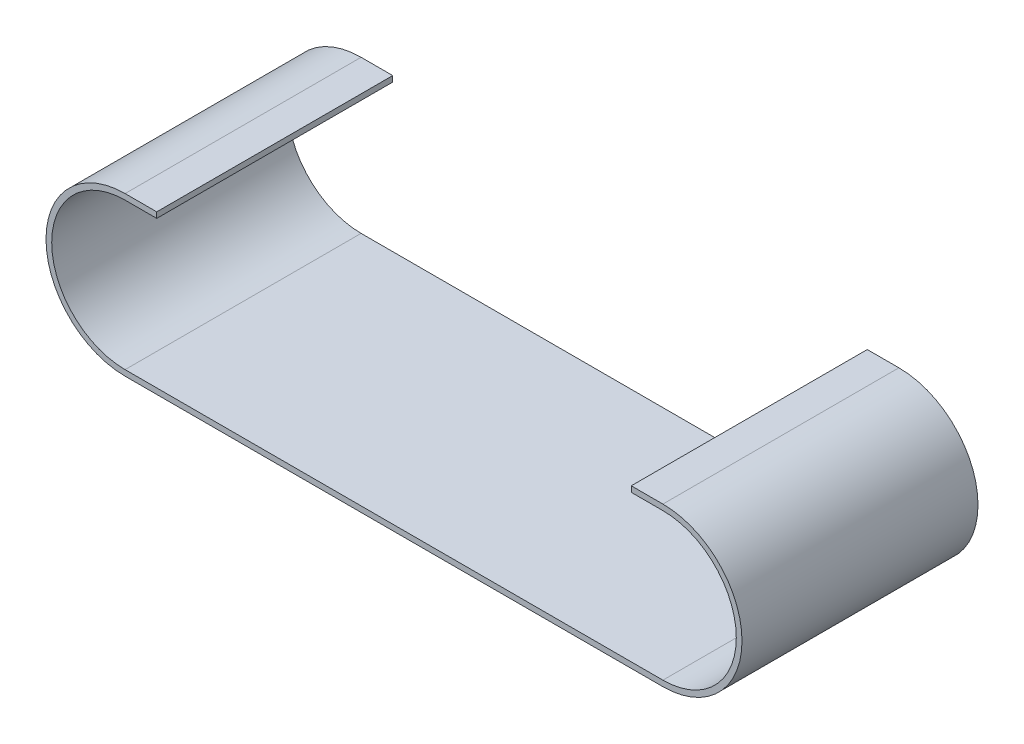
ISO-10303-21;
HEADER;
FILE_DESCRIPTION(('STEP AP214'),'2;1');
FILE_NAME('part.step','',(''),(''),'','','');
FILE_SCHEMA(('AUTOMOTIVE_DESIGN { 1 0 10303 214 1 1 1 1 }'));
ENDSEC;
DATA;
#1=APPLICATION_CONTEXT('core data for automotive mechanical design processes');
#2=APPLICATION_PROTOCOL_DEFINITION('international standard','automotive_design',2000,#1);
#3=PRODUCT_CONTEXT('',#1,'mechanical');
#4=PRODUCT('Part','Part','',(#3));
#5=PRODUCT_RELATED_PRODUCT_CATEGORY('part','',(#4));
#6=PRODUCT_DEFINITION_FORMATION('','',#4);
#7=PRODUCT_DEFINITION_CONTEXT('part definition',#1,'design');
#8=PRODUCT_DEFINITION('design','',#6,#7);
#9=PRODUCT_DEFINITION_SHAPE('','',#8);
#10=(LENGTH_UNIT() NAMED_UNIT(*) SI_UNIT(.MILLI.,.METRE.));
#11=(NAMED_UNIT(*) PLANE_ANGLE_UNIT() SI_UNIT($,.RADIAN.));
#12=(NAMED_UNIT(*) SI_UNIT($,.STERADIAN.) SOLID_ANGLE_UNIT());
#13=UNCERTAINTY_MEASURE_WITH_UNIT(LENGTH_MEASURE(1.E-05),#10,'distance_accuracy_value','');
#14=(GEOMETRIC_REPRESENTATION_CONTEXT(3) GLOBAL_UNCERTAINTY_ASSIGNED_CONTEXT((#13)) GLOBAL_UNIT_ASSIGNED_CONTEXT((#10,
#11,#12)) REPRESENTATION_CONTEXT('',''));
#15=CARTESIAN_POINT('',(0.,0.,0.));
#16=DIRECTION('',(0.,0.,1.));
#17=DIRECTION('',(1.,0.,0.));
#18=AXIS2_PLACEMENT_3D('',#15,#16,#17);
#19=CARTESIAN_POINT('',(-850.,0.,-746.));
#20=DIRECTION('',(0.,0.,1.));
#21=DIRECTION('',(1.,0.,0.));
#22=AXIS2_PLACEMENT_3D('',#19,#20,#21);
#23=CYLINDRICAL_SURFACE('',#22,232.);
#24=CARTESIAN_POINT('',(-850.,0.,0.));
#25=DIRECTION('',(0.,0.,-1.));
#26=DIRECTION('',(1.,0.,0.));
#27=AXIS2_PLACEMENT_3D('',#24,#25,#26);
#28=CIRCLE('',#27,232.);
#29=CARTESIAN_POINT('',(-850.,-232.,0.));
#30=VERTEX_POINT('',#29);
#31=CARTESIAN_POINT('',(-850.,232.,0.));
#32=VERTEX_POINT('',#31);
#33=EDGE_CURVE('E154',#30,#32,#28,.T.);
#34=ORIENTED_EDGE('',*,*,#33,.F.);
#35=DIRECTION('',(0.,0.,1.));
#36=VECTOR('',#35,1.);
#37=CARTESIAN_POINT('',(-850.,-232.,-746.));
#38=LINE('',#37,#36);
#39=CARTESIAN_POINT('',(-850.,-232.,-746.));
#40=VERTEX_POINT('',#39);
#41=EDGE_CURVE('E11',#40,#30,#38,.T.);
#42=ORIENTED_EDGE('',*,*,#41,.F.);
#43=CARTESIAN_POINT('',(-850.,0.,-746.));
#44=DIRECTION('',(0.,0.,-1.));
#45=DIRECTION('',(1.,0.,0.));
#46=AXIS2_PLACEMENT_3D('',#43,#44,#45);
#47=CIRCLE('',#46,232.);
#48=CARTESIAN_POINT('',(-850.,232.,-746.));
#49=VERTEX_POINT('',#48);
#50=EDGE_CURVE('E186',#40,#49,#47,.T.);
#51=ORIENTED_EDGE('',*,*,#50,.T.);
#52=DIRECTION('',(0.,0.,1.));
#53=VECTOR('',#52,1.);
#54=CARTESIAN_POINT('',(-850.,232.,-746.));
#55=LINE('',#54,#53);
#56=EDGE_CURVE('E36',#49,#32,#55,.T.);
#57=ORIENTED_EDGE('',*,*,#56,.T.);
#58=EDGE_LOOP('',(#34,#42,#51,#57));
#59=FACE_BOUND('',#58,.T.);
#60=ADVANCED_FACE('F33',(#59),#23,.F.);
#61=CARTESIAN_POINT('',(-850.,-232.,-746.));
#62=DIRECTION('',(0.,1.,0.));
#63=DIRECTION('',(0.,0.,1.));
#64=AXIS2_PLACEMENT_3D('',#61,#62,#63);
#65=PLANE('',#64);
#66=DIRECTION('',(-1.,0.,0.));
#67=VECTOR('',#66,1.);
#68=CARTESIAN_POINT('',(-850.,-232.,0.));
#69=LINE('',#68,#67);
#70=CARTESIAN_POINT('',(850.,-232.,0.));
#71=VERTEX_POINT('',#70);
#72=EDGE_CURVE('E184',#71,#30,#69,.T.);
#73=ORIENTED_EDGE('',*,*,#72,.F.);
#74=DIRECTION('',(0.,0.,1.));
#75=VECTOR('',#74,1.);
#76=CARTESIAN_POINT('',(850.,-232.,-746.));
#77=LINE('',#76,#75);
#78=CARTESIAN_POINT('',(850.,-232.,-746.));
#79=VERTEX_POINT('',#78);
#80=EDGE_CURVE('E42',#79,#71,#77,.T.);
#81=ORIENTED_EDGE('',*,*,#80,.F.);
#82=DIRECTION('',(-1.,0.,0.));
#83=VECTOR('',#82,1.);
#84=CARTESIAN_POINT('',(-850.,-232.,-746.));
#85=LINE('',#84,#83);
#86=EDGE_CURVE('E144',#79,#40,#85,.T.);
#87=ORIENTED_EDGE('',*,*,#86,.T.);
#88=ORIENTED_EDGE('',*,*,#41,.T.);
#89=EDGE_LOOP('',(#73,#81,#87,#88));
#90=FACE_BOUND('',#89,.T.);
#91=ADVANCED_FACE('F206',(#90),#65,.T.);
#92=CARTESIAN_POINT('',(850.,0.,-746.));
#93=DIRECTION('',(0.,0.,1.));
#94=DIRECTION('',(1.,0.,0.));
#95=AXIS2_PLACEMENT_3D('',#92,#93,#94);
#96=CYLINDRICAL_SURFACE('',#95,232.);
#97=CARTESIAN_POINT('',(850.,0.,0.));
#98=DIRECTION('',(0.,0.,-1.));
#99=DIRECTION('',(1.,0.,0.));
#100=AXIS2_PLACEMENT_3D('',#97,#98,#99);
#101=CIRCLE('',#100,232.);
#102=CARTESIAN_POINT('',(850.,232.,0.));
#103=VERTEX_POINT('',#102);
#104=EDGE_CURVE('E131',#103,#71,#101,.T.);
#105=ORIENTED_EDGE('',*,*,#104,.F.);
#106=DIRECTION('',(0.,0.,1.));
#107=VECTOR('',#106,1.);
#108=CARTESIAN_POINT('',(850.,232.,-746.));
#109=LINE('',#108,#107);
#110=CARTESIAN_POINT('',(850.,232.,-746.));
#111=VERTEX_POINT('',#110);
#112=EDGE_CURVE('E126',#111,#103,#109,.T.);
#113=ORIENTED_EDGE('',*,*,#112,.F.);
#114=CARTESIAN_POINT('',(850.,0.,-746.));
#115=DIRECTION('',(0.,0.,-1.));
#116=DIRECTION('',(1.,0.,0.));
#117=AXIS2_PLACEMENT_3D('',#114,#115,#116);
#118=CIRCLE('',#117,232.);
#119=EDGE_CURVE('E129',#111,#79,#118,.T.);
#120=ORIENTED_EDGE('',*,*,#119,.T.);
#121=ORIENTED_EDGE('',*,*,#80,.T.);
#122=EDGE_LOOP('',(#105,#113,#120,#121));
#123=FACE_BOUND('',#122,.T.);
#124=ADVANCED_FACE('F128',(#123),#96,.F.);
#125=CARTESIAN_POINT('',(850.,232.,-746.));
#126=DIRECTION('',(0.,-1.,0.));
#127=DIRECTION('',(0.,0.,-1.));
#128=AXIS2_PLACEMENT_3D('',#125,#126,#127);
#129=PLANE('',#128);
#130=DIRECTION('',(1.,0.,0.));
#131=VECTOR('',#130,1.);
#132=CARTESIAN_POINT('',(850.,232.,0.));
#133=LINE('',#132,#131);
#134=CARTESIAN_POINT('',(750.,232.,0.));
#135=VERTEX_POINT('',#134);
#136=EDGE_CURVE('E181',#135,#103,#133,.T.);
#137=ORIENTED_EDGE('',*,*,#136,.F.);
#138=DIRECTION('',(0.,0.,1.));
#139=VECTOR('',#138,1.);
#140=CARTESIAN_POINT('',(750.,232.,-746.));
#141=LINE('',#140,#139);
#142=CARTESIAN_POINT('',(750.,232.,-746.));
#143=VERTEX_POINT('',#142);
#144=EDGE_CURVE('E136',#143,#135,#141,.T.);
#145=ORIENTED_EDGE('',*,*,#144,.F.);
#146=DIRECTION('',(1.,0.,0.));
#147=VECTOR('',#146,1.);
#148=CARTESIAN_POINT('',(850.,232.,-746.));
#149=LINE('',#148,#147);
#150=EDGE_CURVE('E142',#143,#111,#149,.T.);
#151=ORIENTED_EDGE('',*,*,#150,.T.);
#152=ORIENTED_EDGE('',*,*,#112,.T.);
#153=EDGE_LOOP('',(#137,#145,#151,#152));
#154=FACE_BOUND('',#153,.T.);
#155=ADVANCED_FACE('F146',(#154),#129,.T.);
#156=CARTESIAN_POINT('',(750.,250.,-746.));
#157=DIRECTION('',(-1.,0.,0.));
#158=DIRECTION('',(0.,0.,1.));
#159=AXIS2_PLACEMENT_3D('',#156,#157,#158);
#160=PLANE('',#159);
#161=DIRECTION('',(0.,-1.,0.));
#162=VECTOR('',#161,1.);
#163=CARTESIAN_POINT('',(750.,250.,0.));
#164=LINE('',#163,#162);
#165=CARTESIAN_POINT('',(750.,250.,0.));
#166=VERTEX_POINT('',#165);
#167=EDGE_CURVE('E178',#166,#135,#164,.T.);
#168=ORIENTED_EDGE('',*,*,#167,.F.);
#169=DIRECTION('',(0.,0.,1.));
#170=VECTOR('',#169,1.);
#171=CARTESIAN_POINT('',(750.,250.,-746.));
#172=LINE('',#171,#170);
#173=CARTESIAN_POINT('',(750.,250.,-746.));
#174=VERTEX_POINT('',#173);
#175=EDGE_CURVE('E190',#174,#166,#172,.T.);
#176=ORIENTED_EDGE('',*,*,#175,.F.);
#177=DIRECTION('',(0.,-1.,0.));
#178=VECTOR('',#177,1.);
#179=CARTESIAN_POINT('',(750.,250.,-746.));
#180=LINE('',#179,#178);
#181=EDGE_CURVE('E147',#174,#143,#180,.T.);
#182=ORIENTED_EDGE('',*,*,#181,.T.);
#183=ORIENTED_EDGE('',*,*,#144,.T.);
#184=EDGE_LOOP('',(#168,#176,#182,#183));
#185=FACE_BOUND('',#184,.T.);
#186=ADVANCED_FACE('F219',(#185),#160,.T.);
#187=CARTESIAN_POINT('',(850.,250.,-746.));
#188=DIRECTION('',(0.,1.,0.));
#189=DIRECTION('',(0.,0.,1.));
#190=AXIS2_PLACEMENT_3D('',#187,#188,#189);
#191=PLANE('',#190);
#192=DIRECTION('',(-1.,0.,0.));
#193=VECTOR('',#192,1.);
#194=CARTESIAN_POINT('',(850.,250.,0.));
#195=LINE('',#194,#193);
#196=CARTESIAN_POINT('',(850.,250.,0.));
#197=VERTEX_POINT('',#196);
#198=EDGE_CURVE('E175',#197,#166,#195,.T.);
#199=ORIENTED_EDGE('',*,*,#198,.F.);
#200=DIRECTION('',(0.,0.,1.));
#201=VECTOR('',#200,1.);
#202=CARTESIAN_POINT('',(850.,250.,-746.));
#203=LINE('',#202,#201);
#204=CARTESIAN_POINT('',(850.,250.,-746.));
#205=VERTEX_POINT('',#204);
#206=EDGE_CURVE('E192',#205,#197,#203,.T.);
#207=ORIENTED_EDGE('',*,*,#206,.F.);
#208=DIRECTION('',(-1.,0.,0.));
#209=VECTOR('',#208,1.);
#210=CARTESIAN_POINT('',(850.,250.,-746.));
#211=LINE('',#210,#209);
#212=EDGE_CURVE('E149',#205,#174,#211,.T.);
#213=ORIENTED_EDGE('',*,*,#212,.T.);
#214=ORIENTED_EDGE('',*,*,#175,.T.);
#215=EDGE_LOOP('',(#199,#207,#213,#214));
#216=FACE_BOUND('',#215,.T.);
#217=ADVANCED_FACE('F222',(#216),#191,.T.);
#218=CARTESIAN_POINT('',(850.,0.,-746.));
#219=DIRECTION('',(0.,0.,1.));
#220=DIRECTION('',(1.,0.,0.));
#221=AXIS2_PLACEMENT_3D('',#218,#219,#220);
#222=CYLINDRICAL_SURFACE('',#221,250.);
#223=CARTESIAN_POINT('',(850.,0.,0.));
#224=DIRECTION('',(0.,0.,1.));
#225=DIRECTION('',(1.,0.,0.));
#226=AXIS2_PLACEMENT_3D('',#223,#224,#225);
#227=CIRCLE('',#226,250.);
#228=CARTESIAN_POINT('',(850.,-250.,0.));
#229=VERTEX_POINT('',#228);
#230=EDGE_CURVE('E172',#229,#197,#227,.T.);
#231=ORIENTED_EDGE('',*,*,#230,.F.);
#232=DIRECTION('',(0.,0.,1.));
#233=VECTOR('',#232,1.);
#234=CARTESIAN_POINT('',(850.,-250.,-746.));
#235=LINE('',#234,#233);
#236=CARTESIAN_POINT('',(850.,-250.,-746.));
#237=VERTEX_POINT('',#236);
#238=EDGE_CURVE('E194',#237,#229,#235,.T.);
#239=ORIENTED_EDGE('',*,*,#238,.F.);
#240=CARTESIAN_POINT('',(850.,0.,-746.));
#241=DIRECTION('',(0.,0.,1.));
#242=DIRECTION('',(1.,0.,0.));
#243=AXIS2_PLACEMENT_3D('',#240,#241,#242);
#244=CIRCLE('',#243,250.);
#245=EDGE_CURVE('E348',#237,#205,#244,.T.);
#246=ORIENTED_EDGE('',*,*,#245,.T.);
#247=ORIENTED_EDGE('',*,*,#206,.T.);
#248=EDGE_LOOP('',(#231,#239,#246,#247));
#249=FACE_BOUND('',#248,.T.);
#250=ADVANCED_FACE('F226',(#249),#222,.T.);
#251=CARTESIAN_POINT('',(-850.,-250.,-746.));
#252=DIRECTION('',(0.,-1.,0.));
#253=DIRECTION('',(0.,0.,-1.));
#254=AXIS2_PLACEMENT_3D('',#251,#252,#253);
#255=PLANE('',#254);
#256=DIRECTION('',(1.,0.,0.));
#257=VECTOR('',#256,1.);
#258=CARTESIAN_POINT('',(-850.,-250.,0.));
#259=LINE('',#258,#257);
#260=CARTESIAN_POINT('',(-850.,-250.,0.));
#261=VERTEX_POINT('',#260);
#262=EDGE_CURVE('E169',#261,#229,#259,.T.);
#263=ORIENTED_EDGE('',*,*,#262,.F.);
#264=DIRECTION('',(0.,0.,1.));
#265=VECTOR('',#264,1.);
#266=CARTESIAN_POINT('',(-850.,-250.,-746.));
#267=LINE('',#266,#265);
#268=CARTESIAN_POINT('',(-850.,-250.,-746.));
#269=VERTEX_POINT('',#268);
#270=EDGE_CURVE('E196',#269,#261,#267,.T.);
#271=ORIENTED_EDGE('',*,*,#270,.F.);
#272=DIRECTION('',(1.,0.,0.));
#273=VECTOR('',#272,1.);
#274=CARTESIAN_POINT('',(-850.,-250.,-746.));
#275=LINE('',#274,#273);
#276=EDGE_CURVE('E352',#269,#237,#275,.T.);
#277=ORIENTED_EDGE('',*,*,#276,.T.);
#278=ORIENTED_EDGE('',*,*,#238,.T.);
#279=EDGE_LOOP('',(#263,#271,#277,#278));
#280=FACE_BOUND('',#279,.T.);
#281=ADVANCED_FACE('F230',(#280),#255,.T.);
#282=CARTESIAN_POINT('',(-850.,0.,-746.));
#283=DIRECTION('',(0.,0.,1.));
#284=DIRECTION('',(1.,0.,0.));
#285=AXIS2_PLACEMENT_3D('',#282,#283,#284);
#286=CYLINDRICAL_SURFACE('',#285,250.);
#287=CARTESIAN_POINT('',(-850.,0.,0.));
#288=DIRECTION('',(0.,0.,1.));
#289=DIRECTION('',(1.,0.,0.));
#290=AXIS2_PLACEMENT_3D('',#287,#288,#289);
#291=CIRCLE('',#290,250.);
#292=CARTESIAN_POINT('',(-850.,250.,0.));
#293=VERTEX_POINT('',#292);
#294=EDGE_CURVE('E166',#293,#261,#291,.T.);
#295=ORIENTED_EDGE('',*,*,#294,.F.);
#296=DIRECTION('',(0.,0.,1.));
#297=VECTOR('',#296,1.);
#298=CARTESIAN_POINT('',(-850.,250.,-746.));
#299=LINE('',#298,#297);
#300=CARTESIAN_POINT('',(-850.,250.,-746.));
#301=VERTEX_POINT('',#300);
#302=EDGE_CURVE('E198',#301,#293,#299,.T.);
#303=ORIENTED_EDGE('',*,*,#302,.F.);
#304=CARTESIAN_POINT('',(-850.,0.,-746.));
#305=DIRECTION('',(0.,0.,1.));
#306=DIRECTION('',(1.,0.,0.));
#307=AXIS2_PLACEMENT_3D('',#304,#305,#306);
#308=CIRCLE('',#307,250.);
#309=EDGE_CURVE('E341',#301,#269,#308,.T.);
#310=ORIENTED_EDGE('',*,*,#309,.T.);
#311=ORIENTED_EDGE('',*,*,#270,.T.);
#312=EDGE_LOOP('',(#295,#303,#310,#311));
#313=FACE_BOUND('',#312,.T.);
#314=ADVANCED_FACE('F234',(#313),#286,.T.);
#315=CARTESIAN_POINT('',(-850.,250.,-746.));
#316=DIRECTION('',(0.,1.,0.));
#317=DIRECTION('',(0.,0.,1.));
#318=AXIS2_PLACEMENT_3D('',#315,#316,#317);
#319=PLANE('',#318);
#320=DIRECTION('',(-1.,0.,0.));
#321=VECTOR('',#320,1.);
#322=CARTESIAN_POINT('',(-850.,250.,0.));
#323=LINE('',#322,#321);
#324=CARTESIAN_POINT('',(-750.,250.,0.));
#325=VERTEX_POINT('',#324);
#326=EDGE_CURVE('E163',#325,#293,#323,.T.);
#327=ORIENTED_EDGE('',*,*,#326,.F.);
#328=DIRECTION('',(0.,0.,1.));
#329=VECTOR('',#328,1.);
#330=CARTESIAN_POINT('',(-750.,250.,-746.));
#331=LINE('',#330,#329);
#332=CARTESIAN_POINT('',(-750.,250.,-746.));
#333=VERTEX_POINT('',#332);
#334=EDGE_CURVE('E200',#333,#325,#331,.T.);
#335=ORIENTED_EDGE('',*,*,#334,.F.);
#336=DIRECTION('',(-1.,0.,0.));
#337=VECTOR('',#336,1.);
#338=CARTESIAN_POINT('',(-850.,250.,-746.));
#339=LINE('',#338,#337);
#340=EDGE_CURVE('E337',#333,#301,#339,.T.);
#341=ORIENTED_EDGE('',*,*,#340,.T.);
#342=ORIENTED_EDGE('',*,*,#302,.T.);
#343=EDGE_LOOP('',(#327,#335,#341,#342));
#344=FACE_BOUND('',#343,.T.);
#345=ADVANCED_FACE('F238',(#344),#319,.T.);
#346=CARTESIAN_POINT('',(-750.,250.,-746.));
#347=DIRECTION('',(1.,0.,0.));
#348=DIRECTION('',(0.,0.,-1.));
#349=AXIS2_PLACEMENT_3D('',#346,#347,#348);
#350=PLANE('',#349);
#351=DIRECTION('',(0.,1.,0.));
#352=VECTOR('',#351,1.);
#353=CARTESIAN_POINT('',(-750.,250.,0.));
#354=LINE('',#353,#352);
#355=CARTESIAN_POINT('',(-750.,232.,0.));
#356=VERTEX_POINT('',#355);
#357=EDGE_CURVE('E160',#356,#325,#354,.T.);
#358=ORIENTED_EDGE('',*,*,#357,.F.);
#359=DIRECTION('',(0.,0.,1.));
#360=VECTOR('',#359,1.);
#361=CARTESIAN_POINT('',(-750.,232.,-746.));
#362=LINE('',#361,#360);
#363=CARTESIAN_POINT('',(-750.,232.,-746.));
#364=VERTEX_POINT('',#363);
#365=EDGE_CURVE('E201',#364,#356,#362,.T.);
#366=ORIENTED_EDGE('',*,*,#365,.F.);
#367=DIRECTION('',(0.,1.,0.));
#368=VECTOR('',#367,1.);
#369=CARTESIAN_POINT('',(-750.,250.,-746.));
#370=LINE('',#369,#368);
#371=EDGE_CURVE('E358',#364,#333,#370,.T.);
#372=ORIENTED_EDGE('',*,*,#371,.T.);
#373=ORIENTED_EDGE('',*,*,#334,.T.);
#374=EDGE_LOOP('',(#358,#366,#372,#373));
#375=FACE_BOUND('',#374,.T.);
#376=ADVANCED_FACE('F242',(#375),#350,.T.);
#377=CARTESIAN_POINT('',(-850.,232.,-746.));
#378=DIRECTION('',(0.,-1.,0.));
#379=DIRECTION('',(0.,0.,-1.));
#380=AXIS2_PLACEMENT_3D('',#377,#378,#379);
#381=PLANE('',#380);
#382=DIRECTION('',(1.,0.,0.));
#383=VECTOR('',#382,1.);
#384=CARTESIAN_POINT('',(-850.,232.,0.));
#385=LINE('',#384,#383);
#386=EDGE_CURVE('E157',#32,#356,#385,.T.);
#387=ORIENTED_EDGE('',*,*,#386,.F.);
#388=ORIENTED_EDGE('',*,*,#56,.F.);
#389=DIRECTION('',(1.,0.,0.));
#390=VECTOR('',#389,1.);
#391=CARTESIAN_POINT('',(-850.,232.,-746.));
#392=LINE('',#391,#390);
#393=EDGE_CURVE('E360',#49,#364,#392,.T.);
#394=ORIENTED_EDGE('',*,*,#393,.T.);
#395=ORIENTED_EDGE('',*,*,#365,.T.);
#396=EDGE_LOOP('',(#387,#388,#394,#395));
#397=FACE_BOUND('',#396,.T.);
#398=ADVANCED_FACE('F203',(#397),#381,.T.);
#399=CARTESIAN_POINT('',(-850.,0.,-746.));
#400=DIRECTION('',(0.,0.,1.));
#401=DIRECTION('',(1.,0.,0.));
#402=AXIS2_PLACEMENT_3D('',#399,#400,#401);
#403=PLANE('',#402);
#404=ORIENTED_EDGE('',*,*,#50,.F.);
#405=ORIENTED_EDGE('',*,*,#86,.F.);
#406=ORIENTED_EDGE('',*,*,#119,.F.);
#407=ORIENTED_EDGE('',*,*,#150,.F.);
#408=ORIENTED_EDGE('',*,*,#181,.F.);
#409=ORIENTED_EDGE('',*,*,#212,.F.);
#410=ORIENTED_EDGE('',*,*,#245,.F.);
#411=ORIENTED_EDGE('',*,*,#276,.F.);
#412=ORIENTED_EDGE('',*,*,#309,.F.);
#413=ORIENTED_EDGE('',*,*,#340,.F.);
#414=ORIENTED_EDGE('',*,*,#371,.F.);
#415=ORIENTED_EDGE('',*,*,#393,.F.);
#416=EDGE_LOOP('',(#404,#405,#406,#407,#408,#409,#410,#411,#412,#413,#414,#415));
#417=FACE_BOUND('',#416,.T.);
#418=ADVANCED_FACE('F140',(#417),#403,.F.);
#419=CARTESIAN_POINT('',(-850.,0.,0.));
#420=DIRECTION('',(0.,0.,1.));
#421=DIRECTION('',(1.,0.,0.));
#422=AXIS2_PLACEMENT_3D('',#419,#420,#421);
#423=PLANE('',#422);
#424=ORIENTED_EDGE('',*,*,#33,.T.);
#425=ORIENTED_EDGE('',*,*,#386,.T.);
#426=ORIENTED_EDGE('',*,*,#357,.T.);
#427=ORIENTED_EDGE('',*,*,#326,.T.);
#428=ORIENTED_EDGE('',*,*,#294,.T.);
#429=ORIENTED_EDGE('',*,*,#262,.T.);
#430=ORIENTED_EDGE('',*,*,#230,.T.);
#431=ORIENTED_EDGE('',*,*,#198,.T.);
#432=ORIENTED_EDGE('',*,*,#167,.T.);
#433=ORIENTED_EDGE('',*,*,#136,.T.);
#434=ORIENTED_EDGE('',*,*,#104,.T.);
#435=ORIENTED_EDGE('',*,*,#72,.T.);
#436=EDGE_LOOP('',(#424,#425,#426,#427,#428,#429,#430,#431,#432,#433,#434,#435));
#437=FACE_BOUND('',#436,.T.);
#438=ADVANCED_FACE('F205',(#437),#423,.T.);
#439=CLOSED_SHELL('',(#60,#91,#124,#155,#186,#217,#250,#281,#314,#345,#376,#398,#418,#438));
#440=MANIFOLD_SOLID_BREP('B2',#439);
#441=ADVANCED_BREP_SHAPE_REPRESENTATION('',(#18,#440),#14);
#442=SHAPE_DEFINITION_REPRESENTATION(#9,#441);
ENDSEC;
END-ISO-10303-21;
